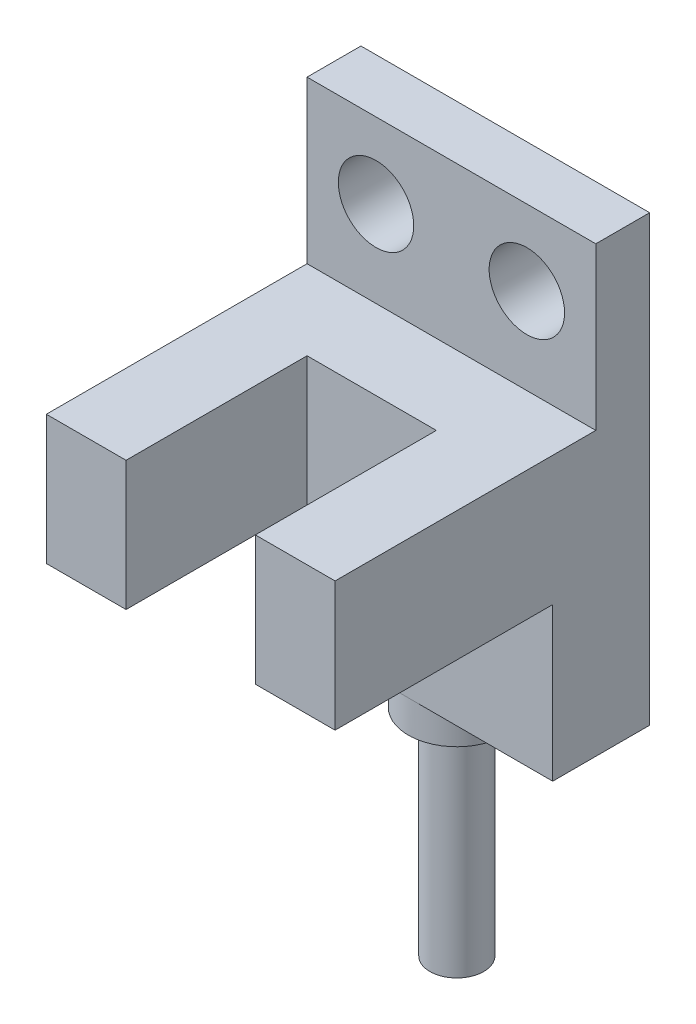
from build123d import *

# Parameters (mm, degrees)
SKETCH_1_W          = 13.4
SKETCH_1_H          = 20.6
EXTRUDE_1_DEPTH     = 4.5
SKETCH_2_W          = 13.4
SKETCH_2_H          = 7.5
CUT_EXTRUDE_2_DEPTH = 2
SKETCH_5_R          = 1.75
CUT_EXTRUDE_3_DEPTH = 2.5
SKETCH_6_W          = 3.7
SKETCH_6_H          = 6
EXTRUDE_2_DEPTH     = 10.1
SKETCH_7_W          = 3.7
SKETCH_7_H          = 6
EXTRUDE_3_DEPTH     = 10.1
SKETCH_8_W          = 6
SKETCH_8_H          = 6
EXTRUDE_4_DEPTH     = 1.7
SKETCH_9_R          = 2.25
EXTRUDE_7_DEPTH     = 1.5
SKETCH_13_R         = 1.25
EXTRUDE_8_DEPTH     = 10


with BuildPart() as part:
    # Sketch 1 → Extrude 1 (new body)
    with BuildSketch(Plane.XY):
        with Locations((6.7, 10.3)):
            Rectangle(SKETCH_1_W, SKETCH_1_H)
    extrude(amount=EXTRUDE_1_DEPTH)

    # Sketch 2 → Cut-Extrude 2 (cut)
    with BuildSketch(Plane.XY.offset(4.5)):
        with Locations((6.7, 16.85)):
            Rectangle(SKETCH_2_W, SKETCH_2_H)
    extrude(amount=-CUT_EXTRUDE_2_DEPTH, mode=Mode.SUBTRACT)

    # Sketch 5 → Cut-Extrude 3 (cut)
    with BuildSketch(Plane.XY.offset(2.5)):
        with Locations((3.2, 17.1)):
            Circle(SKETCH_5_R)
        with Locations((10.2, 17.1)):
            Circle(SKETCH_5_R)
    extrude(amount=-CUT_EXTRUDE_3_DEPTH, mode=Mode.SUBTRACT)

    # Sketch 6 → Extrude 2 (add)
    with BuildSketch(Plane.XY.offset(4.5)):
        with Locations((1.85, 10.1)):
            Rectangle(SKETCH_6_W, SKETCH_6_H)
    extrude(amount=EXTRUDE_2_DEPTH)

    # Sketch 7 → Extrude 3 (add)
    with BuildSketch(Plane.XY.offset(4.5)):
        with Locations((11.55, 10.1)):
            Rectangle(SKETCH_7_W, SKETCH_7_H)
    extrude(amount=EXTRUDE_3_DEPTH)

    # Sketch 8 → Extrude 4 (add)
    with BuildSketch(Plane.XY.offset(4.5)):
        with Locations((6.7, 10.1)):
            Rectangle(SKETCH_8_W, SKETCH_8_H)
    extrude(amount=EXTRUDE_4_DEPTH)

    # Sketch 9 → Extrude 7 (add)
    with BuildSketch(Plane.XZ):
        with Locations(Location((6.7, 2.25, 0), (0, 0, 270))):
            Circle(SKETCH_9_R)
    extrude(amount=EXTRUDE_7_DEPTH)

    # Sketch 13 → Extrude 8 (add)
    with BuildSketch(Plane.XZ.offset(1.5)):
        with Locations(Location((6.7, 2.25, 0), (0, 0, 270))):
            Circle(SKETCH_13_R)
    extrude(amount=EXTRUDE_8_DEPTH)


solid = part.part
